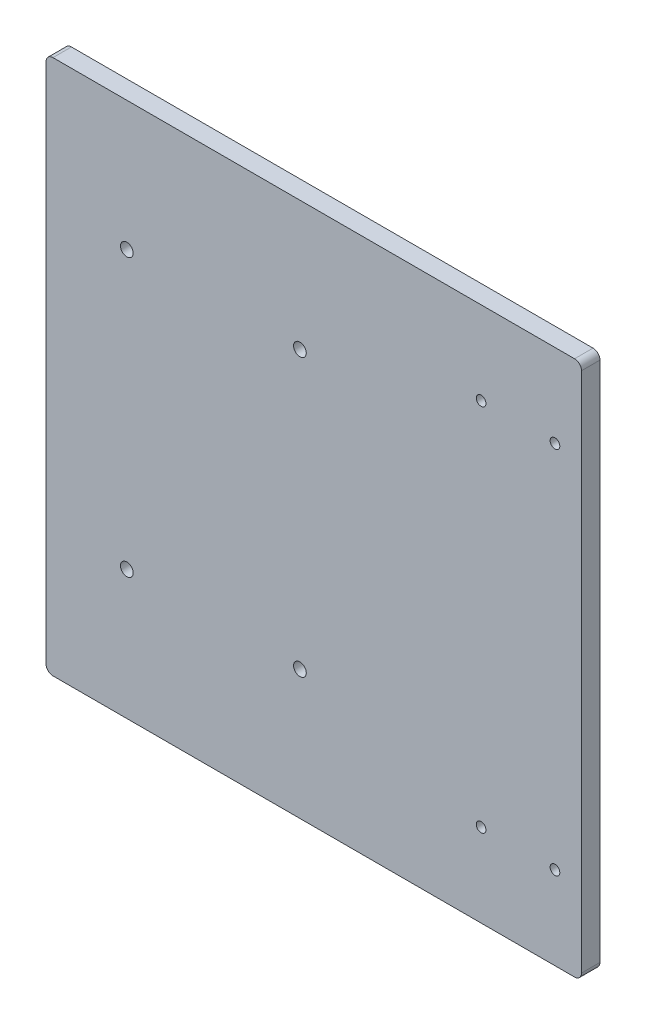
ISO-10303-21;
HEADER;
FILE_DESCRIPTION(('STEP AP214'),'2;1');
FILE_NAME('part.step','',(''),(''),'','','');
FILE_SCHEMA(('AUTOMOTIVE_DESIGN { 1 0 10303 214 1 1 1 1 }'));
ENDSEC;
DATA;
#1=APPLICATION_CONTEXT('core data for automotive mechanical design processes');
#2=APPLICATION_PROTOCOL_DEFINITION('international standard','automotive_design',2000,#1);
#3=PRODUCT_CONTEXT('',#1,'mechanical');
#4=PRODUCT('Part','Part','',(#3));
#5=PRODUCT_RELATED_PRODUCT_CATEGORY('part','',(#4));
#6=PRODUCT_DEFINITION_FORMATION('','',#4);
#7=PRODUCT_DEFINITION_CONTEXT('part definition',#1,'design');
#8=PRODUCT_DEFINITION('design','',#6,#7);
#9=PRODUCT_DEFINITION_SHAPE('','',#8);
#10=(LENGTH_UNIT() NAMED_UNIT(*) SI_UNIT(.MILLI.,.METRE.));
#11=(NAMED_UNIT(*) PLANE_ANGLE_UNIT() SI_UNIT($,.RADIAN.));
#12=(NAMED_UNIT(*) SI_UNIT($,.STERADIAN.) SOLID_ANGLE_UNIT());
#13=UNCERTAINTY_MEASURE_WITH_UNIT(LENGTH_MEASURE(1.E-05),#10,'distance_accuracy_value','');
#14=(GEOMETRIC_REPRESENTATION_CONTEXT(3) GLOBAL_UNCERTAINTY_ASSIGNED_CONTEXT((#13)) GLOBAL_UNIT_ASSIGNED_CONTEXT((#10,
#11,#12)) REPRESENTATION_CONTEXT('',''));
#15=CARTESIAN_POINT('',(0.,0.,0.));
#16=DIRECTION('',(0.,0.,1.));
#17=DIRECTION('',(1.,0.,0.));
#18=AXIS2_PLACEMENT_3D('',#15,#16,#17);
#19=CARTESIAN_POINT('',(0.,0.,8.));
#20=DIRECTION('',(1.,0.,0.));
#21=DIRECTION('',(0.,0.,-1.));
#22=AXIS2_PLACEMENT_3D('',#19,#20,#21);
#23=PLANE('',#22);
#24=DIRECTION('',(0.,-1.,0.));
#25=VECTOR('',#24,1.);
#26=CARTESIAN_POINT('',(0.,0.,0.));
#27=LINE('',#26,#25);
#28=CARTESIAN_POINT('',(0.,229.,0.));
#29=VERTEX_POINT('',#28);
#30=CARTESIAN_POINT('',(0.,3.,0.));
#31=VERTEX_POINT('',#30);
#32=EDGE_CURVE('E129',#29,#31,#27,.T.);
#33=ORIENTED_EDGE('',*,*,#32,.T.);
#34=DIRECTION('',(0.,0.,-1.));
#35=VECTOR('',#34,1.);
#36=CARTESIAN_POINT('',(0.,3.,8.));
#37=LINE('',#36,#35);
#38=CARTESIAN_POINT('',(0.,3.,8.));
#39=VERTEX_POINT('',#38);
#40=EDGE_CURVE('E107',#31,#39,#37,.F.);
#41=ORIENTED_EDGE('',*,*,#40,.T.);
#42=DIRECTION('',(0.,-1.,0.));
#43=VECTOR('',#42,1.);
#44=CARTESIAN_POINT('',(0.,0.,8.));
#45=LINE('',#44,#43);
#46=CARTESIAN_POINT('',(0.,229.,8.));
#47=VERTEX_POINT('',#46);
#48=EDGE_CURVE('E139',#47,#39,#45,.T.);
#49=ORIENTED_EDGE('',*,*,#48,.F.);
#50=DIRECTION('',(0.,0.,-1.));
#51=VECTOR('',#50,1.);
#52=CARTESIAN_POINT('',(0.,229.,8.));
#53=LINE('',#52,#51);
#54=EDGE_CURVE('E112',#47,#29,#53,.T.);
#55=ORIENTED_EDGE('',*,*,#54,.T.);
#56=EDGE_LOOP('',(#33,#41,#49,#55));
#57=FACE_BOUND('',#56,.T.);
#58=ADVANCED_FACE('F36',(#57),#23,.F.);
#59=CARTESIAN_POINT('',(0.,0.,8.));
#60=DIRECTION('',(0.,1.,0.));
#61=DIRECTION('',(0.,0.,1.));
#62=AXIS2_PLACEMENT_3D('',#59,#60,#61);
#63=PLANE('',#62);
#64=DIRECTION('',(1.,0.,0.));
#65=VECTOR('',#64,1.);
#66=CARTESIAN_POINT('',(0.,0.,8.));
#67=LINE('',#66,#65);
#68=CARTESIAN_POINT('',(3.,0.,8.));
#69=VERTEX_POINT('',#68);
#70=CARTESIAN_POINT('',(229.,0.,8.));
#71=VERTEX_POINT('',#70);
#72=EDGE_CURVE('E122',#69,#71,#67,.T.);
#73=ORIENTED_EDGE('',*,*,#72,.F.);
#74=DIRECTION('',(0.,0.,-1.));
#75=VECTOR('',#74,1.);
#76=CARTESIAN_POINT('',(3.,0.,8.));
#77=LINE('',#76,#75);
#78=CARTESIAN_POINT('',(3.,0.,0.));
#79=VERTEX_POINT('',#78);
#80=EDGE_CURVE('E106',#69,#79,#77,.T.);
#81=ORIENTED_EDGE('',*,*,#80,.T.);
#82=DIRECTION('',(1.,0.,0.));
#83=VECTOR('',#82,1.);
#84=CARTESIAN_POINT('',(0.,0.,0.));
#85=LINE('',#84,#83);
#86=CARTESIAN_POINT('',(229.,0.,0.));
#87=VERTEX_POINT('',#86);
#88=EDGE_CURVE('E119',#79,#87,#85,.T.);
#89=ORIENTED_EDGE('',*,*,#88,.T.);
#90=DIRECTION('',(0.,0.,-1.));
#91=VECTOR('',#90,1.);
#92=CARTESIAN_POINT('',(229.,0.,8.));
#93=LINE('',#92,#91);
#94=EDGE_CURVE('E124',#87,#71,#93,.F.);
#95=ORIENTED_EDGE('',*,*,#94,.T.);
#96=EDGE_LOOP('',(#73,#81,#89,#95));
#97=FACE_BOUND('',#96,.T.);
#98=ADVANCED_FACE('F118',(#97),#63,.F.);
#99=CARTESIAN_POINT('',(232.,0.,8.));
#100=DIRECTION('',(-1.,0.,0.));
#101=DIRECTION('',(0.,0.,1.));
#102=AXIS2_PLACEMENT_3D('',#99,#100,#101);
#103=PLANE('',#102);
#104=DIRECTION('',(0.,1.,0.));
#105=VECTOR('',#104,1.);
#106=CARTESIAN_POINT('',(232.,0.,0.));
#107=LINE('',#106,#105);
#108=CARTESIAN_POINT('',(232.,3.,0.));
#109=VERTEX_POINT('',#108);
#110=CARTESIAN_POINT('',(232.,229.,0.));
#111=VERTEX_POINT('',#110);
#112=EDGE_CURVE('E128',#109,#111,#107,.T.);
#113=ORIENTED_EDGE('',*,*,#112,.T.);
#114=DIRECTION('',(0.,0.,-1.));
#115=VECTOR('',#114,1.);
#116=CARTESIAN_POINT('',(232.,229.,8.));
#117=LINE('',#116,#115);
#118=CARTESIAN_POINT('',(232.,229.,8.));
#119=VERTEX_POINT('',#118);
#120=EDGE_CURVE('E11',#111,#119,#117,.F.);
#121=ORIENTED_EDGE('',*,*,#120,.T.);
#122=DIRECTION('',(0.,1.,0.));
#123=VECTOR('',#122,1.);
#124=CARTESIAN_POINT('',(232.,0.,8.));
#125=LINE('',#124,#123);
#126=CARTESIAN_POINT('',(232.,3.,8.));
#127=VERTEX_POINT('',#126);
#128=EDGE_CURVE('E165',#127,#119,#125,.T.);
#129=ORIENTED_EDGE('',*,*,#128,.F.);
#130=DIRECTION('',(0.,0.,-1.));
#131=VECTOR('',#130,1.);
#132=CARTESIAN_POINT('',(232.,3.,8.));
#133=LINE('',#132,#131);
#134=EDGE_CURVE('E44',#127,#109,#133,.T.);
#135=ORIENTED_EDGE('',*,*,#134,.T.);
#136=EDGE_LOOP('',(#113,#121,#129,#135));
#137=FACE_BOUND('',#136,.T.);
#138=ADVANCED_FACE('F163',(#137),#103,.F.);
#139=CARTESIAN_POINT('',(0.,232.,8.));
#140=DIRECTION('',(0.,-1.,0.));
#141=DIRECTION('',(0.,0.,-1.));
#142=AXIS2_PLACEMENT_3D('',#139,#140,#141);
#143=PLANE('',#142);
#144=DIRECTION('',(-1.,0.,0.));
#145=VECTOR('',#144,1.);
#146=CARTESIAN_POINT('',(0.,232.,0.));
#147=LINE('',#146,#145);
#148=CARTESIAN_POINT('',(229.,232.,0.));
#149=VERTEX_POINT('',#148);
#150=CARTESIAN_POINT('',(3.,232.,0.));
#151=VERTEX_POINT('',#150);
#152=EDGE_CURVE('E132',#149,#151,#147,.T.);
#153=ORIENTED_EDGE('',*,*,#152,.T.);
#154=DIRECTION('',(0.,0.,-1.));
#155=VECTOR('',#154,1.);
#156=CARTESIAN_POINT('',(3.,232.,8.));
#157=LINE('',#156,#155);
#158=CARTESIAN_POINT('',(3.,232.,8.));
#159=VERTEX_POINT('',#158);
#160=EDGE_CURVE('E51',#151,#159,#157,.F.);
#161=ORIENTED_EDGE('',*,*,#160,.T.);
#162=DIRECTION('',(-1.,0.,0.));
#163=VECTOR('',#162,1.);
#164=CARTESIAN_POINT('',(0.,232.,8.));
#165=LINE('',#164,#163);
#166=CARTESIAN_POINT('',(229.,232.,8.));
#167=VERTEX_POINT('',#166);
#168=EDGE_CURVE('E140',#167,#159,#165,.T.);
#169=ORIENTED_EDGE('',*,*,#168,.F.);
#170=DIRECTION('',(0.,0.,-1.));
#171=VECTOR('',#170,1.);
#172=CARTESIAN_POINT('',(229.,232.,8.));
#173=LINE('',#172,#171);
#174=EDGE_CURVE('E156',#167,#149,#173,.T.);
#175=ORIENTED_EDGE('',*,*,#174,.T.);
#176=EDGE_LOOP('',(#153,#161,#169,#175));
#177=FACE_BOUND('',#176,.T.);
#178=ADVANCED_FACE('F172',(#177),#143,.F.);
#179=CARTESIAN_POINT('',(0.,0.,8.));
#180=DIRECTION('',(0.,0.,-1.));
#181=DIRECTION('',(-1.,0.,0.));
#182=AXIS2_PLACEMENT_3D('',#179,#180,#181);
#183=PLANE('',#182);
#184=CARTESIAN_POINT('',(220.5,196.,8.));
#185=DIRECTION('',(0.,0.,1.));
#186=DIRECTION('',(1.,0.,0.));
#187=AXIS2_PLACEMENT_3D('',#184,#185,#186);
#188=CIRCLE('',#187,2.09999999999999);
#189=CARTESIAN_POINT('',(222.6,196.,8.));
#190=VERTEX_POINT('',#189);
#191=EDGE_CURVE('E235',#190,#190,#188,.T.);
#192=ORIENTED_EDGE('',*,*,#191,.F.);
#193=EDGE_LOOP('',(#192));
#194=FACE_BOUND('',#193,.T.);
#195=CARTESIAN_POINT('',(220.5,36.,8.));
#196=DIRECTION('',(0.,0.,1.));
#197=DIRECTION('',(1.,0.,0.));
#198=AXIS2_PLACEMENT_3D('',#195,#196,#197);
#199=CIRCLE('',#198,2.09999999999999);
#200=CARTESIAN_POINT('',(222.6,36.,8.));
#201=VERTEX_POINT('',#200);
#202=EDGE_CURVE('E229',#201,#201,#199,.T.);
#203=ORIENTED_EDGE('',*,*,#202,.F.);
#204=EDGE_LOOP('',(#203));
#205=FACE_BOUND('',#204,.T.);
#206=CARTESIAN_POINT('',(188.5,36.,8.));
#207=DIRECTION('',(0.,0.,1.));
#208=DIRECTION('',(1.,0.,0.));
#209=AXIS2_PLACEMENT_3D('',#206,#207,#208);
#210=CIRCLE('',#209,2.09999999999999);
#211=CARTESIAN_POINT('',(190.6,36.,8.));
#212=VERTEX_POINT('',#211);
#213=EDGE_CURVE('E223',#212,#212,#210,.T.);
#214=ORIENTED_EDGE('',*,*,#213,.F.);
#215=EDGE_LOOP('',(#214));
#216=FACE_BOUND('',#215,.T.);
#217=CARTESIAN_POINT('',(188.5,196.,8.));
#218=DIRECTION('',(0.,0.,1.));
#219=DIRECTION('',(1.,0.,0.));
#220=AXIS2_PLACEMENT_3D('',#217,#218,#219);
#221=CIRCLE('',#220,2.09999999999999);
#222=CARTESIAN_POINT('',(190.6,196.,8.));
#223=VERTEX_POINT('',#222);
#224=EDGE_CURVE('E217',#223,#223,#221,.T.);
#225=ORIENTED_EDGE('',*,*,#224,.F.);
#226=EDGE_LOOP('',(#225));
#227=FACE_BOUND('',#226,.T.);
#228=CARTESIAN_POINT('',(35.,56.,8.));
#229=DIRECTION('',(0.,0.,-1.));
#230=DIRECTION('',(-1.,0.,0.));
#231=AXIS2_PLACEMENT_3D('',#228,#229,#230);
#232=CIRCLE('',#231,2.75);
#233=CARTESIAN_POINT('',(32.25,56.,8.));
#234=VERTEX_POINT('',#233);
#235=EDGE_CURVE('E205',#234,#234,#232,.T.);
#236=ORIENTED_EDGE('',*,*,#235,.T.);
#237=EDGE_LOOP('',(#236));
#238=FACE_BOUND('',#237,.T.);
#239=CARTESIAN_POINT('',(35.,176.,8.));
#240=DIRECTION('',(0.,0.,-1.));
#241=DIRECTION('',(-1.,0.,0.));
#242=AXIS2_PLACEMENT_3D('',#239,#240,#241);
#243=CIRCLE('',#242,2.75);
#244=CARTESIAN_POINT('',(32.25,176.,8.));
#245=VERTEX_POINT('',#244);
#246=EDGE_CURVE('E196',#245,#245,#243,.T.);
#247=ORIENTED_EDGE('',*,*,#246,.T.);
#248=EDGE_LOOP('',(#247));
#249=FACE_BOUND('',#248,.T.);
#250=CARTESIAN_POINT('',(110.,56.,8.));
#251=DIRECTION('',(0.,0.,-1.));
#252=DIRECTION('',(-1.,0.,0.));
#253=AXIS2_PLACEMENT_3D('',#250,#251,#252);
#254=CIRCLE('',#253,2.75);
#255=CARTESIAN_POINT('',(107.25,56.,8.));
#256=VERTEX_POINT('',#255);
#257=EDGE_CURVE('E187',#256,#256,#254,.T.);
#258=ORIENTED_EDGE('',*,*,#257,.T.);
#259=EDGE_LOOP('',(#258));
#260=FACE_BOUND('',#259,.T.);
#261=CARTESIAN_POINT('',(110.,176.,8.));
#262=DIRECTION('',(0.,0.,-1.));
#263=DIRECTION('',(-1.,0.,0.));
#264=AXIS2_PLACEMENT_3D('',#261,#262,#263);
#265=CIRCLE('',#264,2.75);
#266=CARTESIAN_POINT('',(107.25,176.,8.));
#267=VERTEX_POINT('',#266);
#268=EDGE_CURVE('E134',#267,#267,#265,.T.);
#269=ORIENTED_EDGE('',*,*,#268,.T.);
#270=EDGE_LOOP('',(#269));
#271=FACE_BOUND('',#270,.T.);
#272=ORIENTED_EDGE('',*,*,#48,.T.);
#273=CARTESIAN_POINT('',(3.,3.,8.));
#274=DIRECTION('',(0.,0.,-1.));
#275=DIRECTION('',(-1.,0.,0.));
#276=AXIS2_PLACEMENT_3D('',#273,#274,#275);
#277=CIRCLE('',#276,3.);
#278=EDGE_CURVE('E154',#39,#69,#277,.F.);
#279=ORIENTED_EDGE('',*,*,#278,.T.);
#280=ORIENTED_EDGE('',*,*,#72,.T.);
#281=CARTESIAN_POINT('',(229.,3.,8.));
#282=DIRECTION('',(0.,0.,-1.));
#283=DIRECTION('',(-1.,0.,0.));
#284=AXIS2_PLACEMENT_3D('',#281,#282,#283);
#285=CIRCLE('',#284,3.);
#286=EDGE_CURVE('E149',#71,#127,#285,.F.);
#287=ORIENTED_EDGE('',*,*,#286,.T.);
#288=ORIENTED_EDGE('',*,*,#128,.T.);
#289=CARTESIAN_POINT('',(229.,229.,8.));
#290=DIRECTION('',(0.,0.,-1.));
#291=DIRECTION('',(-1.,0.,0.));
#292=AXIS2_PLACEMENT_3D('',#289,#290,#291);
#293=CIRCLE('',#292,3.);
#294=EDGE_CURVE('E58',#119,#167,#293,.F.);
#295=ORIENTED_EDGE('',*,*,#294,.T.);
#296=ORIENTED_EDGE('',*,*,#168,.T.);
#297=CARTESIAN_POINT('',(3.,229.,8.));
#298=DIRECTION('',(0.,0.,-1.));
#299=DIRECTION('',(-1.,0.,0.));
#300=AXIS2_PLACEMENT_3D('',#297,#298,#299);
#301=CIRCLE('',#300,3.);
#302=EDGE_CURVE('E152',#159,#47,#301,.F.);
#303=ORIENTED_EDGE('',*,*,#302,.T.);
#304=EDGE_LOOP('',(#272,#279,#280,#287,#288,#295,#296,#303));
#305=FACE_BOUND('',#304,.T.);
#306=ADVANCED_FACE('F241',(#194,#205,#216,#227,#238,#249,#260,#271,#305),#183,.F.);
#307=CARTESIAN_POINT('',(0.,0.,0.));
#308=DIRECTION('',(0.,0.,-1.));
#309=DIRECTION('',(-1.,0.,0.));
#310=AXIS2_PLACEMENT_3D('',#307,#308,#309);
#311=PLANE('',#310);
#312=CARTESIAN_POINT('',(220.5,196.,0.));
#313=DIRECTION('',(0.,0.,1.));
#314=DIRECTION('',(1.,0.,0.));
#315=AXIS2_PLACEMENT_3D('',#312,#313,#314);
#316=CIRCLE('',#315,2.09999999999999);
#317=CARTESIAN_POINT('',(222.6,196.,0.));
#318=VERTEX_POINT('',#317);
#319=EDGE_CURVE('E232',#318,#318,#316,.T.);
#320=ORIENTED_EDGE('',*,*,#319,.T.);
#321=EDGE_LOOP('',(#320));
#322=FACE_BOUND('',#321,.T.);
#323=CARTESIAN_POINT('',(220.5,36.,0.));
#324=DIRECTION('',(0.,0.,1.));
#325=DIRECTION('',(1.,0.,0.));
#326=AXIS2_PLACEMENT_3D('',#323,#324,#325);
#327=CIRCLE('',#326,2.09999999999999);
#328=CARTESIAN_POINT('',(222.6,36.,0.));
#329=VERTEX_POINT('',#328);
#330=EDGE_CURVE('E226',#329,#329,#327,.T.);
#331=ORIENTED_EDGE('',*,*,#330,.T.);
#332=EDGE_LOOP('',(#331));
#333=FACE_BOUND('',#332,.T.);
#334=CARTESIAN_POINT('',(188.5,36.,0.));
#335=DIRECTION('',(0.,0.,1.));
#336=DIRECTION('',(1.,0.,0.));
#337=AXIS2_PLACEMENT_3D('',#334,#335,#336);
#338=CIRCLE('',#337,2.09999999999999);
#339=CARTESIAN_POINT('',(190.6,36.,0.));
#340=VERTEX_POINT('',#339);
#341=EDGE_CURVE('E220',#340,#340,#338,.T.);
#342=ORIENTED_EDGE('',*,*,#341,.T.);
#343=EDGE_LOOP('',(#342));
#344=FACE_BOUND('',#343,.T.);
#345=CARTESIAN_POINT('',(188.5,196.,0.));
#346=DIRECTION('',(0.,0.,1.));
#347=DIRECTION('',(1.,0.,0.));
#348=AXIS2_PLACEMENT_3D('',#345,#346,#347);
#349=CIRCLE('',#348,2.09999999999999);
#350=CARTESIAN_POINT('',(190.6,196.,0.));
#351=VERTEX_POINT('',#350);
#352=EDGE_CURVE('E214',#351,#351,#349,.T.);
#353=ORIENTED_EDGE('',*,*,#352,.T.);
#354=EDGE_LOOP('',(#353));
#355=FACE_BOUND('',#354,.T.);
#356=CARTESIAN_POINT('',(35.,56.,0.));
#357=DIRECTION('',(0.,0.,-1.));
#358=DIRECTION('',(-1.,0.,0.));
#359=AXIS2_PLACEMENT_3D('',#356,#357,#358);
#360=CIRCLE('',#359,5.2);
#361=CARTESIAN_POINT('',(29.8,56.,0.));
#362=VERTEX_POINT('',#361);
#363=EDGE_CURVE('E211',#362,#362,#360,.T.);
#364=ORIENTED_EDGE('',*,*,#363,.F.);
#365=EDGE_LOOP('',(#364));
#366=FACE_BOUND('',#365,.T.);
#367=CARTESIAN_POINT('',(35.,176.,0.));
#368=DIRECTION('',(0.,0.,-1.));
#369=DIRECTION('',(-1.,0.,0.));
#370=AXIS2_PLACEMENT_3D('',#367,#368,#369);
#371=CIRCLE('',#370,5.2);
#372=CARTESIAN_POINT('',(29.8,176.,0.));
#373=VERTEX_POINT('',#372);
#374=EDGE_CURVE('E202',#373,#373,#371,.T.);
#375=ORIENTED_EDGE('',*,*,#374,.F.);
#376=EDGE_LOOP('',(#375));
#377=FACE_BOUND('',#376,.T.);
#378=CARTESIAN_POINT('',(110.,56.,0.));
#379=DIRECTION('',(0.,0.,-1.));
#380=DIRECTION('',(-1.,0.,0.));
#381=AXIS2_PLACEMENT_3D('',#378,#379,#380);
#382=CIRCLE('',#381,5.2);
#383=CARTESIAN_POINT('',(104.8,56.,0.));
#384=VERTEX_POINT('',#383);
#385=EDGE_CURVE('E193',#384,#384,#382,.T.);
#386=ORIENTED_EDGE('',*,*,#385,.F.);
#387=EDGE_LOOP('',(#386));
#388=FACE_BOUND('',#387,.T.);
#389=CARTESIAN_POINT('',(110.,176.,0.));
#390=DIRECTION('',(0.,0.,-1.));
#391=DIRECTION('',(-1.,0.,0.));
#392=AXIS2_PLACEMENT_3D('',#389,#390,#391);
#393=CIRCLE('',#392,5.2);
#394=CARTESIAN_POINT('',(104.8,176.,0.));
#395=VERTEX_POINT('',#394);
#396=EDGE_CURVE('E184',#395,#395,#393,.T.);
#397=ORIENTED_EDGE('',*,*,#396,.F.);
#398=EDGE_LOOP('',(#397));
#399=FACE_BOUND('',#398,.T.);
#400=ORIENTED_EDGE('',*,*,#88,.F.);
#401=CARTESIAN_POINT('',(3.,3.,0.));
#402=DIRECTION('',(0.,0.,-1.));
#403=DIRECTION('',(-1.,0.,0.));
#404=AXIS2_PLACEMENT_3D('',#401,#402,#403);
#405=CIRCLE('',#404,3.);
#406=EDGE_CURVE('E102',#79,#31,#405,.T.);
#407=ORIENTED_EDGE('',*,*,#406,.T.);
#408=ORIENTED_EDGE('',*,*,#32,.F.);
#409=CARTESIAN_POINT('',(3.,229.,0.));
#410=DIRECTION('',(0.,0.,-1.));
#411=DIRECTION('',(-1.,0.,0.));
#412=AXIS2_PLACEMENT_3D('',#409,#410,#411);
#413=CIRCLE('',#412,3.);
#414=EDGE_CURVE('E113',#29,#151,#413,.T.);
#415=ORIENTED_EDGE('',*,*,#414,.T.);
#416=ORIENTED_EDGE('',*,*,#152,.F.);
#417=CARTESIAN_POINT('',(229.,229.,0.));
#418=DIRECTION('',(0.,0.,-1.));
#419=DIRECTION('',(-1.,0.,0.));
#420=AXIS2_PLACEMENT_3D('',#417,#418,#419);
#421=CIRCLE('',#420,3.);
#422=EDGE_CURVE('E143',#149,#111,#421,.T.);
#423=ORIENTED_EDGE('',*,*,#422,.T.);
#424=ORIENTED_EDGE('',*,*,#112,.F.);
#425=CARTESIAN_POINT('',(229.,3.,0.));
#426=DIRECTION('',(0.,0.,-1.));
#427=DIRECTION('',(-1.,0.,0.));
#428=AXIS2_PLACEMENT_3D('',#425,#426,#427);
#429=CIRCLE('',#428,3.);
#430=EDGE_CURVE('E123',#109,#87,#429,.T.);
#431=ORIENTED_EDGE('',*,*,#430,.T.);
#432=EDGE_LOOP('',(#400,#407,#408,#415,#416,#423,#424,#431));
#433=FACE_BOUND('',#432,.T.);
#434=ADVANCED_FACE('F126',(#322,#333,#344,#355,#366,#377,#388,#399,#433),#311,.T.);
#435=CARTESIAN_POINT('',(110.,176.,0.));
#436=DIRECTION('',(0.,0.,-1.));
#437=DIRECTION('',(-1.,0.,0.));
#438=AXIS2_PLACEMENT_3D('',#435,#436,#437);
#439=CYLINDRICAL_SURFACE('',#438,2.75);
#440=ORIENTED_EDGE('',*,*,#268,.F.);
#441=EDGE_LOOP('',(#440));
#442=FACE_BOUND('',#441,.T.);
#443=CARTESIAN_POINT('',(110.,176.,2.45));
#444=DIRECTION('',(0.,0.,-1.));
#445=DIRECTION('',(-1.,0.,0.));
#446=AXIS2_PLACEMENT_3D('',#443,#444,#445);
#447=CIRCLE('',#446,2.75);
#448=CARTESIAN_POINT('',(107.25,176.,2.45));
#449=VERTEX_POINT('',#448);
#450=EDGE_CURVE('E181',#449,#449,#447,.T.);
#451=ORIENTED_EDGE('',*,*,#450,.T.);
#452=EDGE_LOOP('',(#451));
#453=FACE_BOUND('',#452,.T.);
#454=ADVANCED_FACE('F282',(#442,#453),#439,.F.);
#455=CARTESIAN_POINT('',(110.,176.,0.));
#456=DIRECTION('',(0.,0.,-1.));
#457=DIRECTION('',(-1.,0.,0.));
#458=AXIS2_PLACEMENT_3D('',#455,#456,#457);
#459=CONICAL_SURFACE('',#458,5.2,0.785398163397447);
#460=ORIENTED_EDGE('',*,*,#450,.F.);
#461=EDGE_LOOP('',(#460));
#462=FACE_BOUND('',#461,.T.);
#463=ORIENTED_EDGE('',*,*,#396,.T.);
#464=EDGE_LOOP('',(#463));
#465=FACE_BOUND('',#464,.T.);
#466=ADVANCED_FACE('F287',(#462,#465),#459,.F.);
#467=CARTESIAN_POINT('',(110.,56.,0.));
#468=DIRECTION('',(0.,0.,-1.));
#469=DIRECTION('',(-1.,0.,0.));
#470=AXIS2_PLACEMENT_3D('',#467,#468,#469);
#471=CYLINDRICAL_SURFACE('',#470,2.75);
#472=ORIENTED_EDGE('',*,*,#257,.F.);
#473=EDGE_LOOP('',(#472));
#474=FACE_BOUND('',#473,.T.);
#475=CARTESIAN_POINT('',(110.,56.,2.45));
#476=DIRECTION('',(0.,0.,-1.));
#477=DIRECTION('',(-1.,0.,0.));
#478=AXIS2_PLACEMENT_3D('',#475,#476,#477);
#479=CIRCLE('',#478,2.75);
#480=CARTESIAN_POINT('',(107.25,56.,2.45));
#481=VERTEX_POINT('',#480);
#482=EDGE_CURVE('E190',#481,#481,#479,.T.);
#483=ORIENTED_EDGE('',*,*,#482,.T.);
#484=EDGE_LOOP('',(#483));
#485=FACE_BOUND('',#484,.T.);
#486=ADVANCED_FACE('F291',(#474,#485),#471,.F.);
#487=CARTESIAN_POINT('',(110.,56.,0.));
#488=DIRECTION('',(0.,0.,-1.));
#489=DIRECTION('',(-1.,0.,0.));
#490=AXIS2_PLACEMENT_3D('',#487,#488,#489);
#491=CONICAL_SURFACE('',#490,5.2,0.785398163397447);
#492=ORIENTED_EDGE('',*,*,#482,.F.);
#493=EDGE_LOOP('',(#492));
#494=FACE_BOUND('',#493,.T.);
#495=ORIENTED_EDGE('',*,*,#385,.T.);
#496=EDGE_LOOP('',(#495));
#497=FACE_BOUND('',#496,.T.);
#498=ADVANCED_FACE('F295',(#494,#497),#491,.F.);
#499=CARTESIAN_POINT('',(35.,176.,0.));
#500=DIRECTION('',(0.,0.,-1.));
#501=DIRECTION('',(-1.,0.,0.));
#502=AXIS2_PLACEMENT_3D('',#499,#500,#501);
#503=CYLINDRICAL_SURFACE('',#502,2.75);
#504=ORIENTED_EDGE('',*,*,#246,.F.);
#505=EDGE_LOOP('',(#504));
#506=FACE_BOUND('',#505,.T.);
#507=CARTESIAN_POINT('',(35.,176.,2.45));
#508=DIRECTION('',(0.,0.,-1.));
#509=DIRECTION('',(-1.,0.,0.));
#510=AXIS2_PLACEMENT_3D('',#507,#508,#509);
#511=CIRCLE('',#510,2.75);
#512=CARTESIAN_POINT('',(32.25,176.,2.45));
#513=VERTEX_POINT('',#512);
#514=EDGE_CURVE('E199',#513,#513,#511,.T.);
#515=ORIENTED_EDGE('',*,*,#514,.T.);
#516=EDGE_LOOP('',(#515));
#517=FACE_BOUND('',#516,.T.);
#518=ADVANCED_FACE('F299',(#506,#517),#503,.F.);
#519=CARTESIAN_POINT('',(35.,176.,0.));
#520=DIRECTION('',(0.,0.,-1.));
#521=DIRECTION('',(-1.,0.,0.));
#522=AXIS2_PLACEMENT_3D('',#519,#520,#521);
#523=CONICAL_SURFACE('',#522,5.2,0.78539816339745);
#524=ORIENTED_EDGE('',*,*,#514,.F.);
#525=EDGE_LOOP('',(#524));
#526=FACE_BOUND('',#525,.T.);
#527=ORIENTED_EDGE('',*,*,#374,.T.);
#528=EDGE_LOOP('',(#527));
#529=FACE_BOUND('',#528,.T.);
#530=ADVANCED_FACE('F303',(#526,#529),#523,.F.);
#531=CARTESIAN_POINT('',(35.,56.,0.));
#532=DIRECTION('',(0.,0.,-1.));
#533=DIRECTION('',(-1.,0.,0.));
#534=AXIS2_PLACEMENT_3D('',#531,#532,#533);
#535=CYLINDRICAL_SURFACE('',#534,2.75);
#536=ORIENTED_EDGE('',*,*,#235,.F.);
#537=EDGE_LOOP('',(#536));
#538=FACE_BOUND('',#537,.T.);
#539=CARTESIAN_POINT('',(35.,56.,2.45));
#540=DIRECTION('',(0.,0.,-1.));
#541=DIRECTION('',(-1.,0.,0.));
#542=AXIS2_PLACEMENT_3D('',#539,#540,#541);
#543=CIRCLE('',#542,2.75);
#544=CARTESIAN_POINT('',(32.25,56.,2.45));
#545=VERTEX_POINT('',#544);
#546=EDGE_CURVE('E208',#545,#545,#543,.T.);
#547=ORIENTED_EDGE('',*,*,#546,.T.);
#548=EDGE_LOOP('',(#547));
#549=FACE_BOUND('',#548,.T.);
#550=ADVANCED_FACE('F307',(#538,#549),#535,.F.);
#551=CARTESIAN_POINT('',(35.,56.,0.));
#552=DIRECTION('',(0.,0.,-1.));
#553=DIRECTION('',(-1.,0.,0.));
#554=AXIS2_PLACEMENT_3D('',#551,#552,#553);
#555=CONICAL_SURFACE('',#554,5.2,0.78539816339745);
#556=ORIENTED_EDGE('',*,*,#546,.F.);
#557=EDGE_LOOP('',(#556));
#558=FACE_BOUND('',#557,.T.);
#559=ORIENTED_EDGE('',*,*,#363,.T.);
#560=EDGE_LOOP('',(#559));
#561=FACE_BOUND('',#560,.T.);
#562=ADVANCED_FACE('F311',(#558,#561),#555,.F.);
#563=CARTESIAN_POINT('',(188.5,196.,8.));
#564=DIRECTION('',(0.,0.,1.));
#565=DIRECTION('',(1.,0.,0.));
#566=AXIS2_PLACEMENT_3D('',#563,#564,#565);
#567=CYLINDRICAL_SURFACE('',#566,2.09999999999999);
#568=ORIENTED_EDGE('',*,*,#352,.F.);
#569=EDGE_LOOP('',(#568));
#570=FACE_BOUND('',#569,.T.);
#571=ORIENTED_EDGE('',*,*,#224,.T.);
#572=EDGE_LOOP('',(#571));
#573=FACE_BOUND('',#572,.T.);
#574=ADVANCED_FACE('F315',(#570,#573),#567,.F.);
#575=CARTESIAN_POINT('',(188.5,36.,8.));
#576=DIRECTION('',(0.,0.,1.));
#577=DIRECTION('',(1.,0.,0.));
#578=AXIS2_PLACEMENT_3D('',#575,#576,#577);
#579=CYLINDRICAL_SURFACE('',#578,2.09999999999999);
#580=ORIENTED_EDGE('',*,*,#341,.F.);
#581=EDGE_LOOP('',(#580));
#582=FACE_BOUND('',#581,.T.);
#583=ORIENTED_EDGE('',*,*,#213,.T.);
#584=EDGE_LOOP('',(#583));
#585=FACE_BOUND('',#584,.T.);
#586=ADVANCED_FACE('F319',(#582,#585),#579,.F.);
#587=CARTESIAN_POINT('',(220.5,36.,8.));
#588=DIRECTION('',(0.,0.,1.));
#589=DIRECTION('',(1.,0.,0.));
#590=AXIS2_PLACEMENT_3D('',#587,#588,#589);
#591=CYLINDRICAL_SURFACE('',#590,2.09999999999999);
#592=ORIENTED_EDGE('',*,*,#330,.F.);
#593=EDGE_LOOP('',(#592));
#594=FACE_BOUND('',#593,.T.);
#595=ORIENTED_EDGE('',*,*,#202,.T.);
#596=EDGE_LOOP('',(#595));
#597=FACE_BOUND('',#596,.T.);
#598=ADVANCED_FACE('F323',(#594,#597),#591,.F.);
#599=CARTESIAN_POINT('',(220.5,196.,8.));
#600=DIRECTION('',(0.,0.,1.));
#601=DIRECTION('',(1.,0.,0.));
#602=AXIS2_PLACEMENT_3D('',#599,#600,#601);
#603=CYLINDRICAL_SURFACE('',#602,2.09999999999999);
#604=ORIENTED_EDGE('',*,*,#319,.F.);
#605=EDGE_LOOP('',(#604));
#606=FACE_BOUND('',#605,.T.);
#607=ORIENTED_EDGE('',*,*,#191,.T.);
#608=EDGE_LOOP('',(#607));
#609=FACE_BOUND('',#608,.T.);
#610=ADVANCED_FACE('F239',(#606,#609),#603,.F.);
#611=CARTESIAN_POINT('',(3.,3.,8.));
#612=DIRECTION('',(0.,0.,-1.));
#613=DIRECTION('',(-1.,0.,0.));
#614=AXIS2_PLACEMENT_3D('',#611,#612,#613);
#615=CYLINDRICAL_SURFACE('',#614,3.);
#616=ORIENTED_EDGE('',*,*,#278,.F.);
#617=ORIENTED_EDGE('',*,*,#40,.F.);
#618=ORIENTED_EDGE('',*,*,#406,.F.);
#619=ORIENTED_EDGE('',*,*,#80,.F.);
#620=EDGE_LOOP('',(#616,#617,#618,#619));
#621=FACE_BOUND('',#620,.T.);
#622=ADVANCED_FACE('F105',(#621),#615,.T.);
#623=CARTESIAN_POINT('',(3.,229.,8.));
#624=DIRECTION('',(0.,0.,-1.));
#625=DIRECTION('',(-1.,0.,0.));
#626=AXIS2_PLACEMENT_3D('',#623,#624,#625);
#627=CYLINDRICAL_SURFACE('',#626,3.);
#628=ORIENTED_EDGE('',*,*,#302,.F.);
#629=ORIENTED_EDGE('',*,*,#160,.F.);
#630=ORIENTED_EDGE('',*,*,#414,.F.);
#631=ORIENTED_EDGE('',*,*,#54,.F.);
#632=EDGE_LOOP('',(#628,#629,#630,#631));
#633=FACE_BOUND('',#632,.T.);
#634=ADVANCED_FACE('F262',(#633),#627,.T.);
#635=CARTESIAN_POINT('',(229.,229.,8.));
#636=DIRECTION('',(0.,0.,-1.));
#637=DIRECTION('',(-1.,0.,0.));
#638=AXIS2_PLACEMENT_3D('',#635,#636,#637);
#639=CYLINDRICAL_SURFACE('',#638,3.);
#640=ORIENTED_EDGE('',*,*,#294,.F.);
#641=ORIENTED_EDGE('',*,*,#120,.F.);
#642=ORIENTED_EDGE('',*,*,#422,.F.);
#643=ORIENTED_EDGE('',*,*,#174,.F.);
#644=EDGE_LOOP('',(#640,#641,#642,#643));
#645=FACE_BOUND('',#644,.T.);
#646=ADVANCED_FACE('F171',(#645),#639,.T.);
#647=CARTESIAN_POINT('',(229.,3.,8.));
#648=DIRECTION('',(0.,0.,-1.));
#649=DIRECTION('',(-1.,0.,0.));
#650=AXIS2_PLACEMENT_3D('',#647,#648,#649);
#651=CYLINDRICAL_SURFACE('',#650,3.);
#652=ORIENTED_EDGE('',*,*,#286,.F.);
#653=ORIENTED_EDGE('',*,*,#94,.F.);
#654=ORIENTED_EDGE('',*,*,#430,.F.);
#655=ORIENTED_EDGE('',*,*,#134,.F.);
#656=EDGE_LOOP('',(#652,#653,#654,#655));
#657=FACE_BOUND('',#656,.T.);
#658=ADVANCED_FACE('F38',(#657),#651,.T.);
#659=CLOSED_SHELL('',(#58,#98,#138,#178,#306,#434,#454,#466,#486,#498,#518,#530,#550,#562,#574,
#586,#598,#610,#622,#634,#646,#658));
#660=MANIFOLD_SOLID_BREP('B2',#659);
#661=ADVANCED_BREP_SHAPE_REPRESENTATION('',(#18,#660),#14);
#662=SHAPE_DEFINITION_REPRESENTATION(#9,#661);
ENDSEC;
END-ISO-10303-21;
